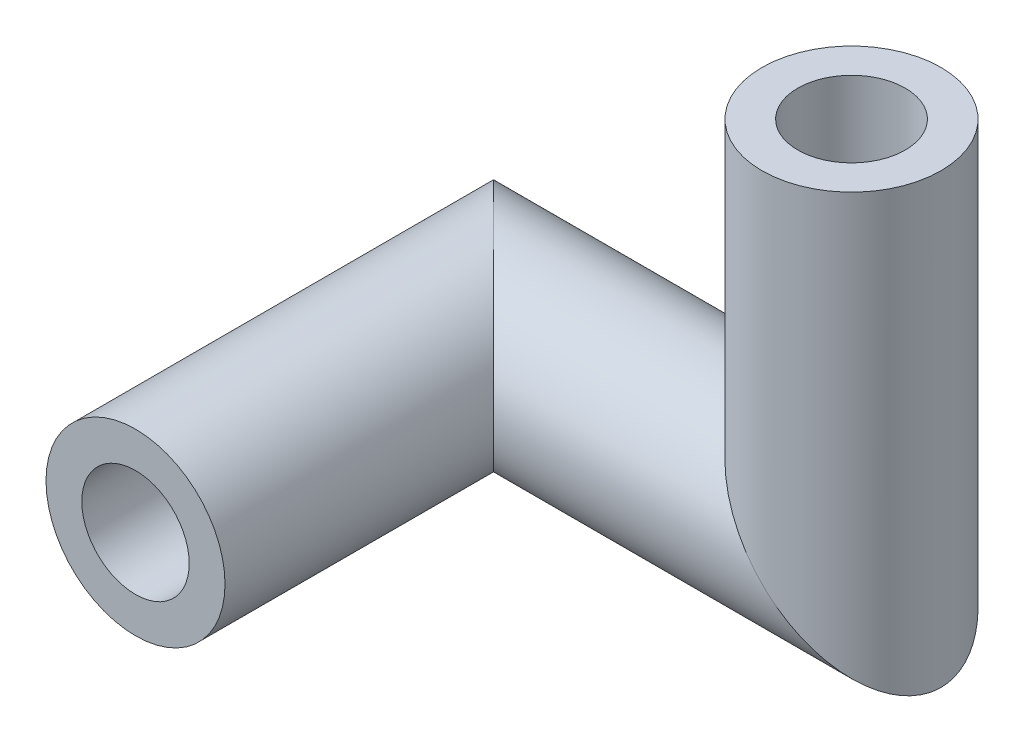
from build123d import *

# Parameters (mm, degrees)
SWEEP_THIN1_PROFILE_R   = 2.5
SWEEP_THIN1_PROFILE_R_2 = 1.5


with BuildPart() as part:
    # Sweep-Thin1: sweep along a curve in space
    with BuildLine() as sweep_thin1_path:
        Line((0, 0, 0), (0, 0, -10))
        Line((0, 0, -10), (10, 0, -10))
        Line((10, 0, -10), (10, 10, -10))
    # Sweep-Thin1 profile (on start of the path) → Sweep-Thin1 (sweep)
    with BuildSketch(Plane(origin=(0, 0, 0), x_dir=(-1, 0, 0), z_dir=(0, 0, -1))):
        Circle(SWEEP_THIN1_PROFILE_R)
        Circle(SWEEP_THIN1_PROFILE_R_2, mode=Mode.SUBTRACT)
    sweep(path=sweep_thin1_path.line, transition=Transition.RIGHT)


solid = part.part
